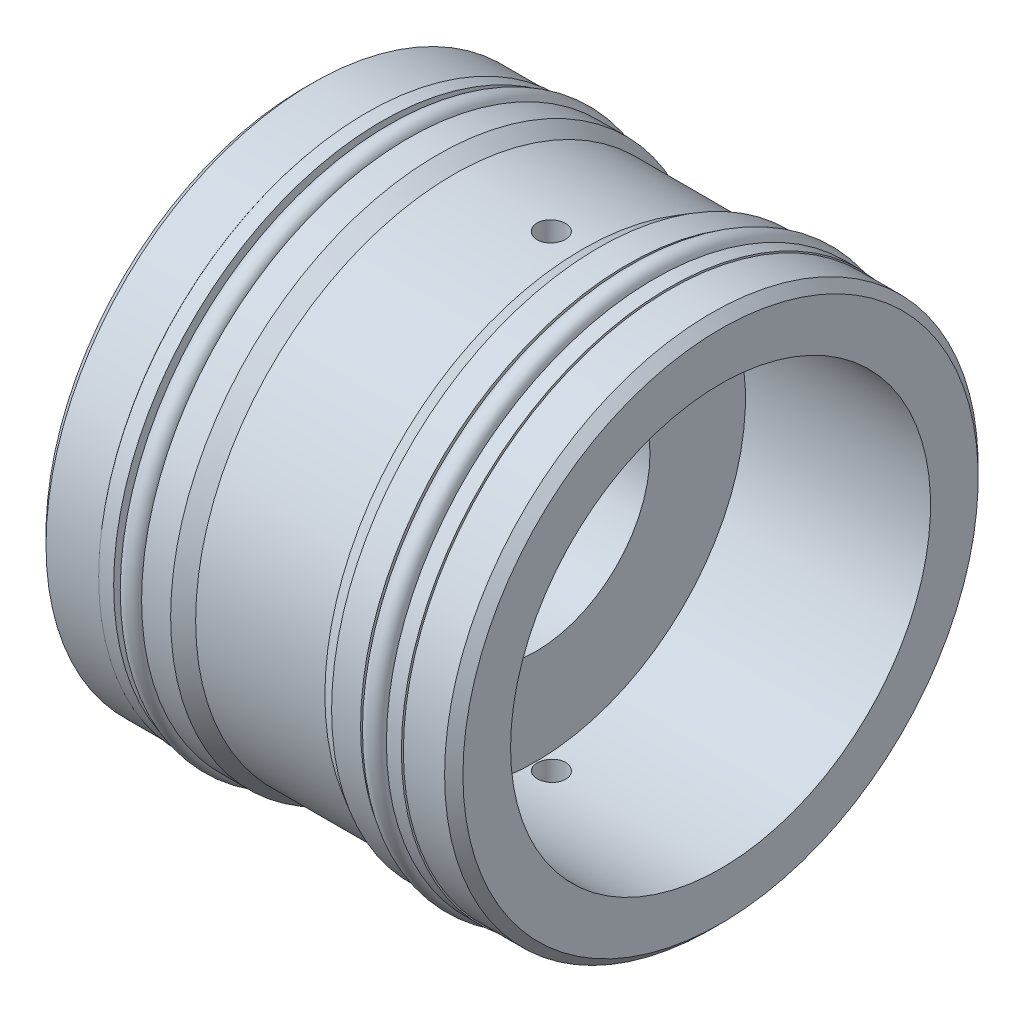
ISO-10303-21;
HEADER;
FILE_DESCRIPTION(('STEP AP214'),'2;1');
FILE_NAME('part.step','',(''),(''),'','','');
FILE_SCHEMA(('AUTOMOTIVE_DESIGN { 1 0 10303 214 1 1 1 1 }'));
ENDSEC;
DATA;
#1=APPLICATION_CONTEXT('core data for automotive mechanical design processes');
#2=APPLICATION_PROTOCOL_DEFINITION('international standard','automotive_design',2000,#1);
#3=PRODUCT_CONTEXT('',#1,'mechanical');
#4=PRODUCT('Part','Part','',(#3));
#5=PRODUCT_RELATED_PRODUCT_CATEGORY('part','',(#4));
#6=PRODUCT_DEFINITION_FORMATION('','',#4);
#7=PRODUCT_DEFINITION_CONTEXT('part definition',#1,'design');
#8=PRODUCT_DEFINITION('design','',#6,#7);
#9=PRODUCT_DEFINITION_SHAPE('','',#8);
#10=(LENGTH_UNIT() NAMED_UNIT(*) SI_UNIT(.MILLI.,.METRE.));
#11=(NAMED_UNIT(*) PLANE_ANGLE_UNIT() SI_UNIT($,.RADIAN.));
#12=(NAMED_UNIT(*) SI_UNIT($,.STERADIAN.) SOLID_ANGLE_UNIT());
#13=UNCERTAINTY_MEASURE_WITH_UNIT(LENGTH_MEASURE(1.E-05),#10,'distance_accuracy_value','');
#14=(GEOMETRIC_REPRESENTATION_CONTEXT(3) GLOBAL_UNCERTAINTY_ASSIGNED_CONTEXT((#13)) GLOBAL_UNIT_ASSIGNED_CONTEXT((#10,
#11,#12)) REPRESENTATION_CONTEXT('',''));
#15=CARTESIAN_POINT('',(0.,0.,0.));
#16=DIRECTION('',(0.,0.,1.));
#17=DIRECTION('',(1.,0.,0.));
#18=AXIS2_PLACEMENT_3D('',#15,#16,#17);
#19=CARTESIAN_POINT('',(0.,0.,0.));
#20=DIRECTION('',(-1.,0.,0.));
#21=DIRECTION('',(0.,0.,1.));
#22=AXIS2_PLACEMENT_3D('',#19,#20,#21);
#23=CYLINDRICAL_SURFACE('',#22,21.4249);
#24=CARTESIAN_POINT('',(5.8556772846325,0.,0.));
#25=DIRECTION('',(1.,0.,0.));
#26=DIRECTION('',(0.,0.,-1.));
#27=AXIS2_PLACEMENT_3D('',#24,#25,#26);
#28=CIRCLE('',#27,21.4249);
#29=CARTESIAN_POINT('',(5.8556772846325,0.,-21.4249));
#30=VERTEX_POINT('',#29);
#31=EDGE_CURVE('E38',#30,#30,#28,.T.);
#32=ORIENTED_EDGE('',*,*,#31,.F.);
#33=EDGE_LOOP('',(#32));
#34=FACE_BOUND('',#33,.T.);
#35=CARTESIAN_POINT('',(3.2639,-21.3923197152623,1.1811));
#36=CARTESIAN_POINT('',(3.3301888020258,-21.3923201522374,1.18109707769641));
#37=CARTESIAN_POINT('',(3.39652438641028,-21.3926311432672,1.17550060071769));
#38=CARTESIAN_POINT('',(3.5273649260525,-21.393841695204,1.15325488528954));
#39=CARTESIAN_POINT('',(3.59186764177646,-21.3947419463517,1.13659268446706));
#40=CARTESIAN_POINT('',(3.71712819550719,-21.3970287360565,1.09269462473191));
#41=CARTESIAN_POINT('',(3.77788794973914,-21.3984150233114,1.06546422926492));
#42=CARTESIAN_POINT('',(3.89395795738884,-21.4015173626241,1.0012113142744));
#43=CARTESIAN_POINT('',(3.94926947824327,-21.4032333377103,0.964191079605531));
#44=CARTESIAN_POINT('',(4.05295557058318,-21.4068040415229,0.881360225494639));
#45=CARTESIAN_POINT('',(4.10132276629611,-21.4086589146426,0.835540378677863));
#46=CARTESIAN_POINT('',(4.18968425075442,-21.4122970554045,0.736429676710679));
#47=CARTESIAN_POINT('',(4.2296781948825,-21.4140803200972,0.683138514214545));
#48=CARTESIAN_POINT('',(4.30017919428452,-21.4173754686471,0.570558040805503));
#49=CARTESIAN_POINT('',(4.33068035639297,-21.4188871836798,0.511265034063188));
#50=CARTESIAN_POINT('',(4.38129219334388,-21.4214674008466,0.38838996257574));
#51=CARTESIAN_POINT('',(4.4014029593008,-21.4225359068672,0.324807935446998));
#52=CARTESIAN_POINT('',(4.43064324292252,-21.4241083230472,0.195228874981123));
#53=CARTESIAN_POINT('',(4.43978401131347,-21.4246128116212,0.129234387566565));
#54=CARTESIAN_POINT('',(4.44685955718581,-21.4250022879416,-0.00335405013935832));
#55=CARTESIAN_POINT('',(4.44479443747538,-21.4248872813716,-0.0699479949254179));
#56=CARTESIAN_POINT('',(4.42952614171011,-21.4240512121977,-0.201768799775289));
#57=CARTESIAN_POINT('',(4.41633507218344,-21.4233308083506,-0.266997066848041));
#58=CARTESIAN_POINT('',(4.37920809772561,-21.4213658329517,-0.394312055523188));
#59=CARTESIAN_POINT('',(4.35527214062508,-21.4201212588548,-0.456398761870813));
#60=CARTESIAN_POINT('',(4.29732107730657,-21.4172469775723,-0.575707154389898));
#61=CARTESIAN_POINT('',(4.26330046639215,-21.4156170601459,-0.632926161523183));
#62=CARTESIAN_POINT('',(4.18614982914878,-21.4121556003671,-0.740845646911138));
#63=CARTESIAN_POINT('',(4.1430197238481,-21.4103240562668,-0.791546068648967));
#64=CARTESIAN_POINT('',(4.04880598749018,-21.4066626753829,-0.885059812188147));
#65=CARTESIAN_POINT('',(3.99771185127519,-21.4048328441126,-0.927862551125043));
#66=CARTESIAN_POINT('',(3.88905729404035,-21.4013836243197,-1.00428436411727));
#67=CARTESIAN_POINT('',(3.83149687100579,-21.3997642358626,-1.03790343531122));
#68=CARTESIAN_POINT('',(3.71153715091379,-21.3969187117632,-1.09500273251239));
#69=CARTESIAN_POINT('',(3.64913765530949,-21.3956925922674,-1.11848254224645));
#70=CARTESIAN_POINT('',(3.52127404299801,-21.3937724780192,-1.15462965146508));
#71=CARTESIAN_POINT('',(3.45580995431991,-21.393078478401,-1.16729704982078));
#72=CARTESIAN_POINT('',(3.32376767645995,-21.3923017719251,-1.18144662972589));
#73=CARTESIAN_POINT('',(3.25719106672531,-21.3922182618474,-1.18294350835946));
#74=CARTESIAN_POINT('',(3.12473253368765,-21.3926698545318,-1.17474792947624));
#75=CARTESIAN_POINT('',(3.05885060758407,-21.3932049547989,-1.16505551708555));
#76=CARTESIAN_POINT('',(2.92969297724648,-21.394832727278,-1.13476868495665));
#77=CARTESIAN_POINT('',(2.86641568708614,-21.3959250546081,-1.11418100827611));
#78=CARTESIAN_POINT('',(2.74421464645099,-21.3985438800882,-1.06269488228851));
#79=CARTESIAN_POINT('',(2.68529092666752,-21.4000703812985,-1.0317963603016));
#80=CARTESIAN_POINT('',(2.57340207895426,-21.4033874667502,-0.960527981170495));
#81=CARTESIAN_POINT('',(2.52044324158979,-21.4051783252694,-0.920148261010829));
#82=CARTESIAN_POINT('',(2.42205077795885,-21.4088213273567,-0.831078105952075));
#83=CARTESIAN_POINT('',(2.37661720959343,-21.4106734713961,-0.78238760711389));
#84=CARTESIAN_POINT('',(2.29451548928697,-21.4142326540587,-0.678014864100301));
#85=CARTESIAN_POINT('',(2.25785683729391,-21.415939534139,-0.622325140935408));
#86=CARTESIAN_POINT('',(2.19441052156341,-21.4190135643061,-0.50557250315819));
#87=CARTESIAN_POINT('',(2.16762280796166,-21.4203807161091,-0.444509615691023));
#88=CARTESIAN_POINT('',(2.12469535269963,-21.422620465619,-0.318779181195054));
#89=CARTESIAN_POINT('',(2.10854955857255,-21.423493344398,-0.254113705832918));
#90=CARTESIAN_POINT('',(2.08734444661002,-21.4246473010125,-0.122984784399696));
#91=CARTESIAN_POINT('',(2.08228504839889,-21.4249283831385,-0.0565213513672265));
#92=CARTESIAN_POINT('',(2.08339710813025,-21.4248670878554,0.0762226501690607));
#93=CARTESIAN_POINT('',(2.08955367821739,-21.4245255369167,0.142503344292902));
#94=CARTESIAN_POINT('',(2.11289209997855,-21.4232590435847,0.273088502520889));
#95=CARTESIAN_POINT('',(2.13007397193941,-21.4223341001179,0.337392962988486));
#96=CARTESIAN_POINT('',(2.17497208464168,-21.4200048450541,0.462203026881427));
#97=CARTESIAN_POINT('',(2.20268835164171,-21.418600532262,0.522708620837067));
#98=CARTESIAN_POINT('',(2.26786615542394,-21.4154703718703,0.638209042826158));
#99=CARTESIAN_POINT('',(2.30532741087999,-21.413744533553,0.69320402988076));
#100=CARTESIAN_POINT('',(2.38898595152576,-21.410162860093,0.796197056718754));
#101=CARTESIAN_POINT('',(2.43519380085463,-21.4083068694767,0.844186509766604));
#102=CARTESIAN_POINT('',(2.53502338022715,-21.4046752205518,0.931742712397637));
#103=CARTESIAN_POINT('',(2.58864692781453,-21.4028995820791,0.97130739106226));
#104=CARTESIAN_POINT('',(2.70183519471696,-21.399627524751,1.04091360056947));
#105=CARTESIAN_POINT('',(2.76140619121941,-21.3981314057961,1.07094492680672));
#106=CARTESIAN_POINT('',(2.88470895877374,-21.395591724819,1.12054330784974));
#107=CARTESIAN_POINT('',(2.94843573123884,-21.3945476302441,1.1401226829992));
#108=CARTESIAN_POINT('',(3.0544467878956,-21.3933052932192,1.16314357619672));
#109=CARTESIAN_POINT('',(3.09604493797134,-21.3929373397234,1.16986859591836));
#110=CARTESIAN_POINT('',(3.17972243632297,-21.3924444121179,1.1788477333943));
#111=CARTESIAN_POINT('',(3.22180178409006,-21.3923194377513,1.18110185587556));
#112=CARTESIAN_POINT('',(3.2639,-21.3923197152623,1.1811));
#113=B_SPLINE_CURVE_WITH_KNOTS('',3,(#35,#36,#37,#38,#39,#40,#41,#42,#43,#44,#45,#46,#47,#48,
#49,#50,#51,#52,#53,#54,#55,#56,#57,#58,#59,#60,#61,#62,#63,#64,#65,#66,#67,#68,#69,#70,#71,#72,
#73,#74,#75,#76,#77,#78,#79,#80,#81,#82,#83,#84,#85,#86,#87,#88,#89,#90,#91,#92,#93,#94,#95,#96,
#97,#98,#99,#100,#101,#102,#103,#104,#105,#106,#107,#108,#109,#110,#111,#112),.UNSPECIFIED.,.T.,
.F.,(4,2,2,2,2,2,2,2,2,2,2,2,2,2,2,2,2,2,2,2,2,2,2,2,2,2,2,2,2,2,2,2,2,2,2,2,2,2,4),(0.,
0.198712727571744,0.397658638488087,0.596501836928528,0.795298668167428,0.994305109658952,
1.19331974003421,1.39245767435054,1.59159386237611,1.7905256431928,1.98945559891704,
2.18816937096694,2.38688410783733,2.58570751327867,2.78453264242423,2.98362229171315,
3.182712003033,3.38180988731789,3.5809059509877,3.77974001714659,3.97857328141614,
4.17728363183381,4.37599538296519,4.57491477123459,4.77383568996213,4.97297100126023,
5.172105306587,5.37112625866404,5.57014576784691,5.76890129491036,5.96765718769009,
6.16641357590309,6.36516422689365,6.56415647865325,6.76319758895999,6.96245104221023,
7.16146910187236,7.28766628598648,7.41386333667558),.UNSPECIFIED.);
#114=CARTESIAN_POINT('',(3.2639,-21.3923197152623,1.1811));
#115=VERTEX_POINT('',#114);
#116=EDGE_CURVE('E49',#115,#115,#113,.T.);
#117=ORIENTED_EDGE('',*,*,#116,.T.);
#118=EDGE_LOOP('',(#117));
#119=FACE_BOUND('',#118,.T.);
#120=CARTESIAN_POINT('',(3.2639,21.3923197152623,1.1811));
#121=CARTESIAN_POINT('',(3.1976111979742,21.3923201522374,1.18109707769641));
#122=CARTESIAN_POINT('',(3.13127561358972,21.3926311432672,1.17550060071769));
#123=CARTESIAN_POINT('',(3.0004350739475,21.393841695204,1.15325488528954));
#124=CARTESIAN_POINT('',(2.93593235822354,21.3947419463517,1.13659268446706));
#125=CARTESIAN_POINT('',(2.81067180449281,21.3970287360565,1.09269462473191));
#126=CARTESIAN_POINT('',(2.74991205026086,21.3984150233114,1.06546422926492));
#127=CARTESIAN_POINT('',(2.63384204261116,21.4015173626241,1.0012113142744));
#128=CARTESIAN_POINT('',(2.57853052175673,21.4032333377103,0.964191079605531));
#129=CARTESIAN_POINT('',(2.47484442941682,21.4068040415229,0.881360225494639));
#130=CARTESIAN_POINT('',(2.42647723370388,21.4086589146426,0.835540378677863));
#131=CARTESIAN_POINT('',(2.33811574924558,21.4122970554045,0.736429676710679));
#132=CARTESIAN_POINT('',(2.2981218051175,21.4140803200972,0.683138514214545));
#133=CARTESIAN_POINT('',(2.22762080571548,21.4173754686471,0.570558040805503));
#134=CARTESIAN_POINT('',(2.19711964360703,21.4188871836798,0.511265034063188));
#135=CARTESIAN_POINT('',(2.14650780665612,21.4214674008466,0.38838996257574));
#136=CARTESIAN_POINT('',(2.1263970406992,21.4225359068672,0.324807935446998));
#137=CARTESIAN_POINT('',(2.09715675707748,21.4241083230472,0.195228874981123));
#138=CARTESIAN_POINT('',(2.08801598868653,21.4246128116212,0.129234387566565));
#139=CARTESIAN_POINT('',(2.08094044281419,21.4250022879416,-0.00335405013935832));
#140=CARTESIAN_POINT('',(2.08300556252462,21.4248872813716,-0.0699479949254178));
#141=CARTESIAN_POINT('',(2.09827385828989,21.4240512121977,-0.201768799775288));
#142=CARTESIAN_POINT('',(2.11146492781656,21.4233308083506,-0.26699706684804));
#143=CARTESIAN_POINT('',(2.14859190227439,21.4213658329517,-0.394312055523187));
#144=CARTESIAN_POINT('',(2.17252785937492,21.4201212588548,-0.456398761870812));
#145=CARTESIAN_POINT('',(2.23047892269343,21.4172469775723,-0.575707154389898));
#146=CARTESIAN_POINT('',(2.26449953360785,21.4156170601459,-0.632926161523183));
#147=CARTESIAN_POINT('',(2.34165017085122,21.4121556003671,-0.740845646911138));
#148=CARTESIAN_POINT('',(2.3847802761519,21.4103240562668,-0.791546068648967));
#149=CARTESIAN_POINT('',(2.47899401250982,21.4066626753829,-0.885059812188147));
#150=CARTESIAN_POINT('',(2.53008814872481,21.4048328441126,-0.927862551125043));
#151=CARTESIAN_POINT('',(2.63874270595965,21.4013836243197,-1.00428436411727));
#152=CARTESIAN_POINT('',(2.69630312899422,21.3997642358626,-1.03790343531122));
#153=CARTESIAN_POINT('',(2.81626284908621,21.3969187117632,-1.09500273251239));
#154=CARTESIAN_POINT('',(2.87866234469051,21.3956925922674,-1.11848254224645));
#155=CARTESIAN_POINT('',(3.00652595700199,21.3937724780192,-1.15462965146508));
#156=CARTESIAN_POINT('',(3.07199004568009,21.393078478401,-1.16729704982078));
#157=CARTESIAN_POINT('',(3.20403232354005,21.3923017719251,-1.18144662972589));
#158=CARTESIAN_POINT('',(3.27060893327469,21.3922182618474,-1.18294350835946));
#159=CARTESIAN_POINT('',(3.40306746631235,21.3926698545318,-1.17474792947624));
#160=CARTESIAN_POINT('',(3.46894939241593,21.3932049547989,-1.16505551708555));
#161=CARTESIAN_POINT('',(3.59810702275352,21.394832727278,-1.13476868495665));
#162=CARTESIAN_POINT('',(3.66138431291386,21.3959250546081,-1.11418100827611));
#163=CARTESIAN_POINT('',(3.78358535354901,21.3985438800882,-1.06269488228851));
#164=CARTESIAN_POINT('',(3.84250907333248,21.4000703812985,-1.0317963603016));
#165=CARTESIAN_POINT('',(3.95439792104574,21.4033874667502,-0.960527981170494));
#166=CARTESIAN_POINT('',(4.00735675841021,21.4051783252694,-0.920148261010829));
#167=CARTESIAN_POINT('',(4.10574922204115,21.4088213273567,-0.831078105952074));
#168=CARTESIAN_POINT('',(4.15118279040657,21.4106734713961,-0.782387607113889));
#169=CARTESIAN_POINT('',(4.23328451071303,21.4142326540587,-0.6780148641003));
#170=CARTESIAN_POINT('',(4.26994316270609,21.415939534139,-0.622325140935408));
#171=CARTESIAN_POINT('',(4.33338947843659,21.4190135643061,-0.50557250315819));
#172=CARTESIAN_POINT('',(4.36017719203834,21.4203807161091,-0.444509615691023));
#173=CARTESIAN_POINT('',(4.40310464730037,21.422620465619,-0.318779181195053));
#174=CARTESIAN_POINT('',(4.41925044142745,21.423493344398,-0.254113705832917));
#175=CARTESIAN_POINT('',(4.44045555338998,21.4246473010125,-0.122984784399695));
#176=CARTESIAN_POINT('',(4.44551495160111,21.4249283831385,-0.0565213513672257));
#177=CARTESIAN_POINT('',(4.44440289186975,21.4248670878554,0.0762226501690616));
#178=CARTESIAN_POINT('',(4.43824632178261,21.4245255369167,0.142503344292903));
#179=CARTESIAN_POINT('',(4.41490790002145,21.4232590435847,0.27308850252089));
#180=CARTESIAN_POINT('',(4.39772602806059,21.4223341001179,0.337392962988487));
#181=CARTESIAN_POINT('',(4.35282791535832,21.4200048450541,0.462203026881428));
#182=CARTESIAN_POINT('',(4.32511164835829,21.418600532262,0.522708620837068));
#183=CARTESIAN_POINT('',(4.25993384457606,21.4154703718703,0.638209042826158));
#184=CARTESIAN_POINT('',(4.22247258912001,21.413744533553,0.69320402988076));
#185=CARTESIAN_POINT('',(4.13881404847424,21.410162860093,0.796197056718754));
#186=CARTESIAN_POINT('',(4.09260619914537,21.4083068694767,0.844186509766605));
#187=CARTESIAN_POINT('',(3.99277661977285,21.4046752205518,0.931742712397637));
#188=CARTESIAN_POINT('',(3.93915307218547,21.4028995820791,0.97130739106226));
#189=CARTESIAN_POINT('',(3.82596480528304,21.399627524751,1.04091360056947));
#190=CARTESIAN_POINT('',(3.76639380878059,21.3981314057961,1.07094492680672));
#191=CARTESIAN_POINT('',(3.64309104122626,21.395591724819,1.12054330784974));
#192=CARTESIAN_POINT('',(3.57936426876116,21.3945476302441,1.1401226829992));
#193=CARTESIAN_POINT('',(3.4733532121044,21.3933052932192,1.16314357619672));
#194=CARTESIAN_POINT('',(3.43175506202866,21.3929373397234,1.16986859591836));
#195=CARTESIAN_POINT('',(3.34807756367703,21.3924444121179,1.1788477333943));
#196=CARTESIAN_POINT('',(3.30599821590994,21.3923194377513,1.18110185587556));
#197=CARTESIAN_POINT('',(3.2639,21.3923197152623,1.1811));
#198=B_SPLINE_CURVE_WITH_KNOTS('',3,(#120,#121,#122,#123,#124,#125,#126,#127,#128,#129,#130,
#131,#132,#133,#134,#135,#136,#137,#138,#139,#140,#141,#142,#143,#144,#145,#146,#147,#148,#149,
#150,#151,#152,#153,#154,#155,#156,#157,#158,#159,#160,#161,#162,#163,#164,#165,#166,#167,#168,
#169,#170,#171,#172,#173,#174,#175,#176,#177,#178,#179,#180,#181,#182,#183,#184,#185,#186,#187,
#188,#189,#190,#191,#192,#193,#194,#195,#196,#197),.UNSPECIFIED.,.T.,.F.,(4,2,2,2,2,2,2,2,2,2,2,
2,2,2,2,2,2,2,2,2,2,2,2,2,2,2,2,2,2,2,2,2,2,2,2,2,2,2,4),(0.,0.198712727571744,
0.397658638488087,0.596501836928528,0.795298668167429,0.994305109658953,1.19331974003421,
1.39245767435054,1.59159386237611,1.7905256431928,1.98945559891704,2.18816937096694,
2.38688410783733,2.58570751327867,2.78453264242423,2.98362229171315,3.18271200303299,
3.38180988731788,3.5809059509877,3.77974001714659,3.97857328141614,4.17728363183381,
4.37599538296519,4.57491477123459,4.77383568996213,4.97297100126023,5.172105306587,
5.37112625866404,5.57014576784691,5.76890129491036,5.96765718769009,6.16641357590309,
6.36516422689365,6.56415647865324,6.76319758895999,6.96245104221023,7.16146910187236,
7.28766628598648,7.41386333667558),.UNSPECIFIED.);
#199=CARTESIAN_POINT('',(3.2639,21.3923197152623,1.1811));
#200=VERTEX_POINT('',#199);
#201=EDGE_CURVE('E57',#200,#200,#198,.T.);
#202=ORIENTED_EDGE('',*,*,#201,.T.);
#203=EDGE_LOOP('',(#202));
#204=FACE_BOUND('',#203,.T.);
#205=CARTESIAN_POINT('',(-4.8904772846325,0.,0.));
#206=DIRECTION('',(-1.,0.,0.));
#207=DIRECTION('',(0.,0.,1.));
#208=AXIS2_PLACEMENT_3D('',#205,#206,#207);
#209=CIRCLE('',#208,21.4249);
#210=CARTESIAN_POINT('',(-4.8904772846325,0.,21.4249));
#211=VERTEX_POINT('',#210);
#212=EDGE_CURVE('E10',#211,#211,#209,.T.);
#213=ORIENTED_EDGE('',*,*,#212,.F.);
#214=EDGE_LOOP('',(#213));
#215=FACE_BOUND('',#214,.T.);
#216=ADVANCED_FACE('F31',(#34,#119,#204,#215),#23,.T.);
#217=CARTESIAN_POINT('',(0.,0.,0.));
#218=DIRECTION('',(-1.,0.,0.));
#219=DIRECTION('',(0.,0.,1.));
#220=AXIS2_PLACEMENT_3D('',#217,#218,#219);
#221=CYLINDRICAL_SURFACE('',#220,20.9296);
#222=CARTESIAN_POINT('',(10.9138071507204,0.,0.));
#223=DIRECTION('',(-1.,0.,0.));
#224=DIRECTION('',(0.,0.,1.));
#225=AXIS2_PLACEMENT_3D('',#222,#223,#224);
#226=CIRCLE('',#225,20.9296);
#227=CARTESIAN_POINT('',(10.9138071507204,0.,20.9296));
#228=VERTEX_POINT('',#227);
#229=EDGE_CURVE('E207',#228,#228,#226,.T.);
#230=ORIENTED_EDGE('',*,*,#229,.F.);
#231=EDGE_LOOP('',(#230));
#232=FACE_BOUND('',#231,.T.);
#233=CARTESIAN_POINT('',(11.8237,0.,0.));
#234=DIRECTION('',(1.,0.,0.));
#235=DIRECTION('',(0.,0.,-1.));
#236=AXIS2_PLACEMENT_3D('',#233,#234,#235);
#237=CIRCLE('',#236,20.9296);
#238=CARTESIAN_POINT('',(11.8237,0.,-20.9296));
#239=VERTEX_POINT('',#238);
#240=EDGE_CURVE('E42',#239,#239,#237,.T.);
#241=ORIENTED_EDGE('',*,*,#240,.F.);
#242=EDGE_LOOP('',(#241));
#243=FACE_BOUND('',#242,.T.);
#244=ADVANCED_FACE('F122',(#232,#243),#221,.T.);
#245=CARTESIAN_POINT('',(13.1445,0.,0.));
#246=DIRECTION('',(-1.,0.,0.));
#247=DIRECTION('',(0.,0.,1.));
#248=AXIS2_PLACEMENT_3D('',#245,#246,#247);
#249=CIRCLE('',#248,20.9296);
#250=CARTESIAN_POINT('',(13.1445,0.,20.9296));
#251=VERTEX_POINT('',#250);
#252=EDGE_CURVE('E168',#251,#251,#249,.T.);
#253=ORIENTED_EDGE('',*,*,#252,.T.);
#254=EDGE_LOOP('',(#253));
#255=FACE_BOUND('',#254,.T.);
#256=CARTESIAN_POINT('',(13.0683,0.,0.));
#257=DIRECTION('',(-1.,0.,0.));
#258=DIRECTION('',(0.,0.,1.));
#259=AXIS2_PLACEMENT_3D('',#256,#257,#258);
#260=CIRCLE('',#259,20.9296);
#261=CARTESIAN_POINT('',(13.0683,0.,20.9296));
#262=VERTEX_POINT('',#261);
#263=EDGE_CURVE('E46',#262,#262,#260,.T.);
#264=ORIENTED_EDGE('',*,*,#263,.F.);
#265=EDGE_LOOP('',(#264));
#266=FACE_BOUND('',#265,.T.);
#267=ADVANCED_FACE('F127',(#255,#266),#221,.T.);
#268=CARTESIAN_POINT('',(9.5885,0.,0.));
#269=DIRECTION('',(-1.,0.,0.));
#270=DIRECTION('',(0.,0.,1.));
#271=AXIS2_PLACEMENT_3D('',#268,#269,#270);
#272=CIRCLE('',#271,20.9296);
#273=CARTESIAN_POINT('',(9.5885,0.,20.9296));
#274=VERTEX_POINT('',#273);
#275=EDGE_CURVE('E159',#274,#274,#272,.T.);
#276=ORIENTED_EDGE('',*,*,#275,.F.);
#277=EDGE_LOOP('',(#276));
#278=FACE_BOUND('',#277,.T.);
#279=CARTESIAN_POINT('',(10.1935928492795,0.,0.));
#280=DIRECTION('',(1.,0.,0.));
#281=DIRECTION('',(0.,0.,-1.));
#282=AXIS2_PLACEMENT_3D('',#279,#280,#281);
#283=CIRCLE('',#282,20.9296);
#284=CARTESIAN_POINT('',(10.1935928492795,0.,-20.9296));
#285=VERTEX_POINT('',#284);
#286=EDGE_CURVE('E210',#285,#285,#283,.T.);
#287=ORIENTED_EDGE('',*,*,#286,.F.);
#288=EDGE_LOOP('',(#287));
#289=FACE_BOUND('',#288,.T.);
#290=ADVANCED_FACE('F130',(#278,#289),#221,.T.);
#291=CARTESIAN_POINT('',(0.,0.,0.));
#292=DIRECTION('',(-1.,0.,0.));
#293=DIRECTION('',(0.,0.,1.));
#294=AXIS2_PLACEMENT_3D('',#291,#292,#293);
#295=CYLINDRICAL_SURFACE('',#294,20.9296);
#296=CARTESIAN_POINT('',(-10.8585,0.,0.));
#297=DIRECTION('',(-1.,0.,0.));
#298=DIRECTION('',(0.,0.,1.));
#299=AXIS2_PLACEMENT_3D('',#296,#297,#298);
#300=CIRCLE('',#299,20.9296);
#301=CARTESIAN_POINT('',(-10.8585,0.,20.9296));
#302=VERTEX_POINT('',#301);
#303=EDGE_CURVE('E195',#302,#302,#300,.T.);
#304=ORIENTED_EDGE('',*,*,#303,.F.);
#305=EDGE_LOOP('',(#304));
#306=FACE_BOUND('',#305,.T.);
#307=CARTESIAN_POINT('',(-9.94860715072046,0.,0.));
#308=DIRECTION('',(1.,0.,0.));
#309=DIRECTION('',(0.,0.,-1.));
#310=AXIS2_PLACEMENT_3D('',#307,#308,#309);
#311=CIRCLE('',#310,20.9296);
#312=CARTESIAN_POINT('',(-9.94860715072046,0.,-20.9296));
#313=VERTEX_POINT('',#312);
#314=EDGE_CURVE('E204',#313,#313,#311,.T.);
#315=ORIENTED_EDGE('',*,*,#314,.F.);
#316=EDGE_LOOP('',(#315));
#317=FACE_BOUND('',#316,.T.);
#318=ADVANCED_FACE('F222',(#306,#317),#295,.T.);
#319=CARTESIAN_POINT('',(-8.6233,0.,0.));
#320=DIRECTION('',(-1.,0.,0.));
#321=DIRECTION('',(0.,0.,1.));
#322=AXIS2_PLACEMENT_3D('',#319,#320,#321);
#323=CIRCLE('',#322,20.9296);
#324=CARTESIAN_POINT('',(-8.6233,0.,20.9296));
#325=VERTEX_POINT('',#324);
#326=EDGE_CURVE('E162',#325,#325,#323,.T.);
#327=ORIENTED_EDGE('',*,*,#326,.T.);
#328=EDGE_LOOP('',(#327));
#329=FACE_BOUND('',#328,.T.);
#330=CARTESIAN_POINT('',(-9.22839284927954,0.,0.));
#331=DIRECTION('',(-1.,0.,0.));
#332=DIRECTION('',(0.,0.,1.));
#333=AXIS2_PLACEMENT_3D('',#330,#331,#332);
#334=CIRCLE('',#333,20.9296);
#335=CARTESIAN_POINT('',(-9.22839284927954,0.,20.9296));
#336=VERTEX_POINT('',#335);
#337=EDGE_CURVE('E201',#336,#336,#334,.T.);
#338=ORIENTED_EDGE('',*,*,#337,.F.);
#339=EDGE_LOOP('',(#338));
#340=FACE_BOUND('',#339,.T.);
#341=ADVANCED_FACE('F270',(#329,#340),#295,.T.);
#342=CARTESIAN_POINT('',(-12.1793,0.,0.));
#343=DIRECTION('',(-1.,0.,0.));
#344=DIRECTION('',(0.,0.,1.));
#345=AXIS2_PLACEMENT_3D('',#342,#343,#344);
#346=CIRCLE('',#345,20.9296);
#347=CARTESIAN_POINT('',(-12.1793,0.,20.9296));
#348=VERTEX_POINT('',#347);
#349=EDGE_CURVE('E259',#348,#348,#346,.T.);
#350=ORIENTED_EDGE('',*,*,#349,.F.);
#351=EDGE_LOOP('',(#350));
#352=FACE_BOUND('',#351,.T.);
#353=CARTESIAN_POINT('',(-12.1031,0.,0.));
#354=DIRECTION('',(1.,0.,0.));
#355=DIRECTION('',(0.,0.,-1.));
#356=AXIS2_PLACEMENT_3D('',#353,#354,#355);
#357=CIRCLE('',#356,20.9296);
#358=CARTESIAN_POINT('',(-12.1031,0.,-20.9296));
#359=VERTEX_POINT('',#358);
#360=EDGE_CURVE('E198',#359,#359,#357,.T.);
#361=ORIENTED_EDGE('',*,*,#360,.F.);
#362=EDGE_LOOP('',(#361));
#363=FACE_BOUND('',#362,.T.);
#364=ADVANCED_FACE('F104',(#352,#363),#295,.T.);
#365=CARTESIAN_POINT('',(0.,0.,0.));
#366=DIRECTION('',(-1.,0.,0.));
#367=DIRECTION('',(0.,0.,1.));
#368=AXIS2_PLACEMENT_3D('',#365,#366,#367);
#369=CYLINDRICAL_SURFACE('',#368,9.525);
#370=CARTESIAN_POINT('',(1.9431,0.,0.));
#371=DIRECTION('',(-1.,0.,0.));
#372=DIRECTION('',(0.,0.,1.));
#373=AXIS2_PLACEMENT_3D('',#370,#371,#372);
#374=CIRCLE('',#373,9.525);
#375=CARTESIAN_POINT('',(1.9431,0.,9.525));
#376=VERTEX_POINT('',#375);
#377=EDGE_CURVE('E180',#376,#376,#374,.T.);
#378=ORIENTED_EDGE('',*,*,#377,.F.);
#379=EDGE_LOOP('',(#378));
#380=FACE_BOUND('',#379,.T.);
#381=CARTESIAN_POINT('',(-17.3355,0.,0.));
#382=DIRECTION('',(-1.,0.,0.));
#383=DIRECTION('',(0.,0.,1.));
#384=AXIS2_PLACEMENT_3D('',#381,#382,#383);
#385=CIRCLE('',#384,9.525);
#386=CARTESIAN_POINT('',(-17.3355,0.,9.525));
#387=VERTEX_POINT('',#386);
#388=EDGE_CURVE('E253',#387,#387,#385,.T.);
#389=ORIENTED_EDGE('',*,*,#388,.T.);
#390=EDGE_LOOP('',(#389));
#391=FACE_BOUND('',#390,.T.);
#392=ADVANCED_FACE('F101',(#380,#391),#369,.F.);
#393=CARTESIAN_POINT('',(1.9431,9.525,0.));
#394=DIRECTION('',(-1.,0.,0.));
#395=DIRECTION('',(0.,0.,1.));
#396=AXIS2_PLACEMENT_3D('',#393,#394,#395);
#397=PLANE('',#396);
#398=CARTESIAN_POINT('',(1.9431,0.,0.));
#399=DIRECTION('',(-1.,0.,0.));
#400=DIRECTION('',(0.,0.,1.));
#401=AXIS2_PLACEMENT_3D('',#398,#399,#400);
#402=CIRCLE('',#401,17.4625);
#403=CARTESIAN_POINT('',(1.9431,0.,17.4625));
#404=VERTEX_POINT('',#403);
#405=EDGE_CURVE('E177',#404,#404,#402,.T.);
#406=ORIENTED_EDGE('',*,*,#405,.F.);
#407=EDGE_LOOP('',(#406));
#408=FACE_BOUND('',#407,.T.);
#409=ORIENTED_EDGE('',*,*,#377,.T.);
#410=EDGE_LOOP('',(#409));
#411=FACE_BOUND('',#410,.T.);
#412=ADVANCED_FACE('F95',(#408,#411),#397,.F.);
#413=CARTESIAN_POINT('',(0.,0.,0.));
#414=DIRECTION('',(-1.,0.,0.));
#415=DIRECTION('',(0.,0.,1.));
#416=AXIS2_PLACEMENT_3D('',#413,#414,#415);
#417=CYLINDRICAL_SURFACE('',#416,17.4625);
#418=CARTESIAN_POINT('',(3.2639,-17.4225115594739,1.1811));
#419=CARTESIAN_POINT('',(3.19763855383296,-17.4225120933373,1.18109708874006));
#420=CARTESIAN_POINT('',(3.13133099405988,-17.4228936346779,1.1755052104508));
#421=CARTESIAN_POINT('',(3.00054761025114,-17.4243787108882,1.15327882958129));
#422=CARTESIAN_POINT('',(2.93607399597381,-17.4254830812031,1.13663154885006));
#423=CARTESIAN_POINT('',(2.81087179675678,-17.4282881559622,1.0927754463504));
#424=CARTESIAN_POINT('',(2.75014122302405,-17.4299885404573,1.06557229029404));
#425=CARTESIAN_POINT('',(2.63412380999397,-17.4337936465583,1.00138601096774));
#426=CARTESIAN_POINT('',(2.57883574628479,-17.4358982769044,0.964405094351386));
#427=CARTESIAN_POINT('',(2.47516116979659,-17.4402788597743,0.881642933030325));
#428=CARTESIAN_POINT('',(2.42678537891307,-17.442555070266,0.835848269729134));
#429=CARTESIAN_POINT('',(2.33840041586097,-17.4470199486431,0.736786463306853));
#430=CARTESIAN_POINT('',(2.29839159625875,-17.4492086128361,0.683519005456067));
#431=CARTESIAN_POINT('',(2.22784263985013,-17.4532540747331,0.570962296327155));
#432=CARTESIAN_POINT('',(2.19731147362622,-17.455110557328,0.511667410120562));
#433=CARTESIAN_POINT('',(2.14664191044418,-17.4582797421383,0.388778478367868));
#434=CARTESIAN_POINT('',(2.12650338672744,-17.4595924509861,0.325184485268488));
#435=CARTESIAN_POINT('',(2.09722078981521,-17.4615243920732,0.195606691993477));
#436=CARTESIAN_POINT('',(2.08805978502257,-17.4621446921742,0.129626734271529));
#437=CARTESIAN_POINT('',(2.08093997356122,-17.4626255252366,-0.00293710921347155));
#438=CARTESIAN_POINT('',(2.0829810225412,-17.4624860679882,-0.0695209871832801));
#439=CARTESIAN_POINT('',(2.09819344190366,-17.4614639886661,-0.201287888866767));
#440=CARTESIAN_POINT('',(2.1113466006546,-17.4605825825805,-0.26647302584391));
#441=CARTESIAN_POINT('',(2.14838159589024,-17.4581772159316,-0.393708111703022));
#442=CARTESIAN_POINT('',(2.17226350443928,-17.4566532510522,-0.455758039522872));
#443=CARTESIAN_POINT('',(2.23009863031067,-17.4531322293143,-0.575019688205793));
#444=CARTESIAN_POINT('',(2.26406007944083,-17.4511347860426,-0.632227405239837));
#445=CARTESIAN_POINT('',(2.34108426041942,-17.4468915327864,-0.740136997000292));
#446=CARTESIAN_POINT('',(2.38414711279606,-17.4446457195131,-0.790838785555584));
#447=CARTESIAN_POINT('',(2.47825451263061,-17.4401530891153,-0.884403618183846));
#448=CARTESIAN_POINT('',(2.52931487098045,-17.4379062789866,-0.927250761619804));
#449=CARTESIAN_POINT('',(2.63791253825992,-17.4336694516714,-1.00376738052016));
#450=CARTESIAN_POINT('',(2.6954498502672,-17.4316794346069,-1.03743685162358));
#451=CARTESIAN_POINT('',(2.81537849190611,-17.4281809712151,-1.09464135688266));
#452=CARTESIAN_POINT('',(2.87777015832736,-17.4266725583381,-1.11817568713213));
#453=CARTESIAN_POINT('',(3.00563165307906,-17.4243085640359,-1.15443070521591));
#454=CARTESIAN_POINT('',(3.07110143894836,-17.4234529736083,-1.1671515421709));
#455=CARTESIAN_POINT('',(3.20312193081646,-17.4224928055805,-1.18139859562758));
#456=CARTESIAN_POINT('',(3.26967023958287,-17.4223867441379,-1.1829469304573));
#457=CARTESIAN_POINT('',(3.40208070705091,-17.422933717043,-1.1748628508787));
#458=CARTESIAN_POINT('',(3.46794286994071,-17.4235867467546,-1.16523050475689));
#459=CARTESIAN_POINT('',(3.59704870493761,-17.4255769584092,-1.13507687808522));
#460=CARTESIAN_POINT('',(3.66029477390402,-17.4269134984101,-1.11456581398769));
#461=CARTESIAN_POINT('',(3.78244713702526,-17.4301195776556,-1.06324734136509));
#462=CARTESIAN_POINT('',(3.84135338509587,-17.431989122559,-1.03243982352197));
#463=CARTESIAN_POINT('',(3.95325548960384,-17.4360541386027,-0.96134655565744));
#464=CARTESIAN_POINT('',(4.00624192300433,-17.4382501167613,-0.921046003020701));
#465=CARTESIAN_POINT('',(4.10470531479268,-17.4427187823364,-0.832132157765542));
#466=CARTESIAN_POINT('',(4.15018218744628,-17.4449914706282,-0.78351877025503));
#467=CARTESIAN_POINT('',(4.23241042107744,-17.449361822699,-0.679263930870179));
#468=CARTESIAN_POINT('',(4.26914745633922,-17.4514591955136,-0.623611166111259));
#469=CARTESIAN_POINT('',(4.33275509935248,-17.4552384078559,-0.50691412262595));
#470=CARTESIAN_POINT('',(4.3596257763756,-17.4569202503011,-0.445869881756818));
#471=CARTESIAN_POINT('',(4.40271309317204,-17.4596775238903,-0.320175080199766));
#472=CARTESIAN_POINT('',(4.41893875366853,-17.4607534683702,-0.255527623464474));
#473=CARTESIAN_POINT('',(4.44030496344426,-17.4621797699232,-0.124418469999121));
#474=CARTESIAN_POINT('',(4.44544564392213,-17.4625301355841,-0.0579567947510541));
#475=CARTESIAN_POINT('',(4.4444946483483,-17.4624658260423,0.0747525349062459));
#476=CARTESIAN_POINT('',(4.43842537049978,-17.4620526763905,0.141000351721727));
#477=CARTESIAN_POINT('',(4.41527324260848,-17.4605108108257,0.27153386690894));
#478=CARTESIAN_POINT('',(4.39819037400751,-17.459382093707,0.335819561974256));
#479=CARTESIAN_POINT('',(4.35350119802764,-17.4565359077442,0.460606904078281));
#480=CARTESIAN_POINT('',(4.3258950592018,-17.4548184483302,0.52110861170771));
#481=CARTESIAN_POINT('',(4.26094591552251,-17.4509874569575,0.636621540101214));
#482=CARTESIAN_POINT('',(4.22360314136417,-17.4488739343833,0.691632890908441));
#483=CARTESIAN_POINT('',(4.14015747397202,-17.4444834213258,0.794717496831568));
#484=CARTESIAN_POINT('',(4.09403826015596,-17.4422061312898,0.842777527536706));
#485=CARTESIAN_POINT('',(3.9943732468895,-17.4377472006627,0.930490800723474));
#486=CARTESIAN_POINT('',(3.94082563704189,-17.4355655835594,0.970141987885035));
#487=CARTESIAN_POINT('',(3.82775340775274,-17.4315416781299,1.03994662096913));
#488=CARTESIAN_POINT('',(3.76822065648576,-17.4296998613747,1.07008690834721));
#489=CARTESIAN_POINT('',(3.6449698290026,-17.4265700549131,1.11990682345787));
#490=CARTESIAN_POINT('',(3.5812567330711,-17.4252814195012,1.13959865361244));
#491=CARTESIAN_POINT('',(3.47494734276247,-17.4237402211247,1.16286709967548));
#492=CARTESIAN_POINT('',(3.43303752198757,-17.4232815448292,1.16969554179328));
#493=CARTESIAN_POINT('',(3.34872476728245,-17.4226670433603,1.17881292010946));
#494=CARTESIAN_POINT('',(3.30632183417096,-17.4225112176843,1.18110186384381));
#495=CARTESIAN_POINT('',(3.2639,-17.4225115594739,1.1811));
#496=B_SPLINE_CURVE_WITH_KNOTS('',3,(#418,#419,#420,#421,#422,#423,#424,#425,#426,#427,#428,
#429,#430,#431,#432,#433,#434,#435,#436,#437,#438,#439,#440,#441,#442,#443,#444,#445,#446,#447,
#448,#449,#450,#451,#452,#453,#454,#455,#456,#457,#458,#459,#460,#461,#462,#463,#464,#465,#466,
#467,#468,#469,#470,#471,#472,#473,#474,#475,#476,#477,#478,#479,#480,#481,#482,#483,#484,#485,
#486,#487,#488,#489,#490,#491,#492,#493,#494,#495),.UNSPECIFIED.,.T.,.F.,(4,2,2,2,2,2,2,2,2,2,2,
2,2,2,2,2,2,2,2,2,2,2,2,2,2,2,2,2,2,2,2,2,2,2,2,2,2,2,4),(0.,0.198629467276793,0.39748891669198,
0.596241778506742,0.794949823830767,0.993962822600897,1.19298420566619,1.39219339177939,
1.59140014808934,1.7902992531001,1.98919579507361,2.18776699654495,2.38633953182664,
2.58507468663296,2.78381247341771,2.98294823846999,3.18208409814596,3.38123378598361,
3.58038072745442,3.7791333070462,3.977884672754,4.17644971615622,4.3750168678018,
4.5738957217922,4.77277684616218,4.97198175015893,5.17118525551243,5.37021973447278,
5.56925185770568,5.76788673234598,5.9665219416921,6.16515396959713,6.36378129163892,
6.56278165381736,6.7618306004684,6.9611537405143,7.16024358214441,7.2874101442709,
7.41457649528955),.UNSPECIFIED.);
#497=CARTESIAN_POINT('',(3.2639,-17.4225115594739,1.1811));
#498=VERTEX_POINT('',#497);
#499=EDGE_CURVE('E84',#498,#498,#496,.T.);
#500=ORIENTED_EDGE('',*,*,#499,.T.);
#501=EDGE_LOOP('',(#500));
#502=FACE_BOUND('',#501,.T.);
#503=CARTESIAN_POINT('',(3.2639,17.4225115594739,1.1811));
#504=CARTESIAN_POINT('',(3.33016144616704,17.4225120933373,1.18109708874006));
#505=CARTESIAN_POINT('',(3.39646900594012,17.4228936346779,1.1755052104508));
#506=CARTESIAN_POINT('',(3.52725238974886,17.4243787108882,1.15327882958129));
#507=CARTESIAN_POINT('',(3.59172600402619,17.4254830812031,1.13663154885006));
#508=CARTESIAN_POINT('',(3.71692820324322,17.4282881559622,1.0927754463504));
#509=CARTESIAN_POINT('',(3.77765877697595,17.4299885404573,1.06557229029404));
#510=CARTESIAN_POINT('',(3.89367619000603,17.4337936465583,1.00138601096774));
#511=CARTESIAN_POINT('',(3.94896425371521,17.4358982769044,0.964405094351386));
#512=CARTESIAN_POINT('',(4.05263883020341,17.4402788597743,0.881642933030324));
#513=CARTESIAN_POINT('',(4.10101462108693,17.442555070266,0.835848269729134));
#514=CARTESIAN_POINT('',(4.18939958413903,17.4470199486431,0.736786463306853));
#515=CARTESIAN_POINT('',(4.22940840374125,17.4492086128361,0.683519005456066));
#516=CARTESIAN_POINT('',(4.29995736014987,17.4532540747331,0.570962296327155));
#517=CARTESIAN_POINT('',(4.33048852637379,17.455110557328,0.511667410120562));
#518=CARTESIAN_POINT('',(4.38115808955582,17.4582797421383,0.388778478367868));
#519=CARTESIAN_POINT('',(4.40129661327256,17.4595924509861,0.325184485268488));
#520=CARTESIAN_POINT('',(4.43057921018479,17.4615243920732,0.195606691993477));
#521=CARTESIAN_POINT('',(4.43974021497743,17.4621446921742,0.129626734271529));
#522=CARTESIAN_POINT('',(4.44686002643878,17.4626255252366,-0.00293710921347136));
#523=CARTESIAN_POINT('',(4.4448189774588,17.4624860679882,-0.0695209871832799));
#524=CARTESIAN_POINT('',(4.42960655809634,17.4614639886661,-0.201287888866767));
#525=CARTESIAN_POINT('',(4.4164533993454,17.4605825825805,-0.266473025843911));
#526=CARTESIAN_POINT('',(4.37941840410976,17.4581772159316,-0.393708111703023));
#527=CARTESIAN_POINT('',(4.35553649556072,17.4566532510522,-0.455758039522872));
#528=CARTESIAN_POINT('',(4.29770136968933,17.4531322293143,-0.575019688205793));
#529=CARTESIAN_POINT('',(4.26373992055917,17.4511347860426,-0.632227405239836));
#530=CARTESIAN_POINT('',(4.18671573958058,17.4468915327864,-0.740136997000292));
#531=CARTESIAN_POINT('',(4.14365288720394,17.4446457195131,-0.790838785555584));
#532=CARTESIAN_POINT('',(4.04954548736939,17.4401530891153,-0.884403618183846));
#533=CARTESIAN_POINT('',(3.99848512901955,17.4379062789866,-0.927250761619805));
#534=CARTESIAN_POINT('',(3.88988746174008,17.4336694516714,-1.00376738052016));
#535=CARTESIAN_POINT('',(3.8323501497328,17.4316794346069,-1.03743685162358));
#536=CARTESIAN_POINT('',(3.71242150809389,17.4281809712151,-1.09464135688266));
#537=CARTESIAN_POINT('',(3.65002984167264,17.4266725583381,-1.11817568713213));
#538=CARTESIAN_POINT('',(3.52216834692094,17.4243085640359,-1.15443070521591));
#539=CARTESIAN_POINT('',(3.45669856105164,17.4234529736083,-1.1671515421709));
#540=CARTESIAN_POINT('',(3.32467806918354,17.4224928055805,-1.18139859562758));
#541=CARTESIAN_POINT('',(3.25812976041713,17.4223867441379,-1.1829469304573));
#542=CARTESIAN_POINT('',(3.12571929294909,17.422933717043,-1.1748628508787));
#543=CARTESIAN_POINT('',(3.05985713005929,17.4235867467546,-1.16523050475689));
#544=CARTESIAN_POINT('',(2.93075129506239,17.4255769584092,-1.13507687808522));
#545=CARTESIAN_POINT('',(2.86750522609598,17.4269134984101,-1.11456581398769));
#546=CARTESIAN_POINT('',(2.74535286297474,17.4301195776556,-1.06324734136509));
#547=CARTESIAN_POINT('',(2.68644661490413,17.431989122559,-1.03243982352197));
#548=CARTESIAN_POINT('',(2.57454451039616,17.4360541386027,-0.96134655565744));
#549=CARTESIAN_POINT('',(2.52155807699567,17.4382501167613,-0.9210460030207));
#550=CARTESIAN_POINT('',(2.42309468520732,17.4427187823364,-0.832132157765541));
#551=CARTESIAN_POINT('',(2.37761781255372,17.4449914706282,-0.78351877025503));
#552=CARTESIAN_POINT('',(2.29538957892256,17.449361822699,-0.679263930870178));
#553=CARTESIAN_POINT('',(2.25865254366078,17.4514591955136,-0.623611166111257));
#554=CARTESIAN_POINT('',(2.19504490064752,17.4552384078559,-0.506914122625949));
#555=CARTESIAN_POINT('',(2.16817422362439,17.4569202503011,-0.445869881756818));
#556=CARTESIAN_POINT('',(2.12508690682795,17.4596775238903,-0.320175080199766));
#557=CARTESIAN_POINT('',(2.10886124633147,17.4607534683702,-0.255527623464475));
#558=CARTESIAN_POINT('',(2.08749503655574,17.4621797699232,-0.124418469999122));
#559=CARTESIAN_POINT('',(2.08235435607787,17.4625301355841,-0.0579567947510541));
#560=CARTESIAN_POINT('',(2.0833053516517,17.4624658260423,0.0747525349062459));
#561=CARTESIAN_POINT('',(2.08937462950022,17.4620526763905,0.141000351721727));
#562=CARTESIAN_POINT('',(2.11252675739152,17.4605108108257,0.27153386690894));
#563=CARTESIAN_POINT('',(2.12960962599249,17.459382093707,0.335819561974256));
#564=CARTESIAN_POINT('',(2.17429880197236,17.4565359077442,0.460606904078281));
#565=CARTESIAN_POINT('',(2.2019049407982,17.4548184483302,0.52110861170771));
#566=CARTESIAN_POINT('',(2.26685408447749,17.4509874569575,0.636621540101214));
#567=CARTESIAN_POINT('',(2.30419685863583,17.4488739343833,0.691632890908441));
#568=CARTESIAN_POINT('',(2.38764252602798,17.4444834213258,0.794717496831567));
#569=CARTESIAN_POINT('',(2.43376173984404,17.4422061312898,0.842777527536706));
#570=CARTESIAN_POINT('',(2.5334267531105,17.4377472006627,0.930490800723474));
#571=CARTESIAN_POINT('',(2.58697436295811,17.4355655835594,0.970141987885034));
#572=CARTESIAN_POINT('',(2.70004659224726,17.4315416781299,1.03994662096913));
#573=CARTESIAN_POINT('',(2.75957934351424,17.4296998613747,1.07008690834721));
#574=CARTESIAN_POINT('',(2.8828301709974,17.4265700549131,1.11990682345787));
#575=CARTESIAN_POINT('',(2.9465432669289,17.4252814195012,1.13959865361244));
#576=CARTESIAN_POINT('',(3.05285265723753,17.4237402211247,1.16286709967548));
#577=CARTESIAN_POINT('',(3.09476247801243,17.4232815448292,1.16969554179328));
#578=CARTESIAN_POINT('',(3.17907523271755,17.4226670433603,1.17881292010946));
#579=CARTESIAN_POINT('',(3.22147816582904,17.4225112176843,1.18110186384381));
#580=CARTESIAN_POINT('',(3.2639,17.4225115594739,1.1811));
#581=B_SPLINE_CURVE_WITH_KNOTS('',3,(#503,#504,#505,#506,#507,#508,#509,#510,#511,#512,#513,
#514,#515,#516,#517,#518,#519,#520,#521,#522,#523,#524,#525,#526,#527,#528,#529,#530,#531,#532,
#533,#534,#535,#536,#537,#538,#539,#540,#541,#542,#543,#544,#545,#546,#547,#548,#549,#550,#551,
#552,#553,#554,#555,#556,#557,#558,#559,#560,#561,#562,#563,#564,#565,#566,#567,#568,#569,#570,
#571,#572,#573,#574,#575,#576,#577,#578,#579,#580),.UNSPECIFIED.,.T.,.F.,(4,2,2,2,2,2,2,2,2,2,2,
2,2,2,2,2,2,2,2,2,2,2,2,2,2,2,2,2,2,2,2,2,2,2,2,2,2,2,4),(0.,0.198629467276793,0.39748891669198,
0.596241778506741,0.794949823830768,0.993962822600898,1.19298420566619,1.39219339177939,
1.59140014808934,1.7902992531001,1.98919579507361,2.18776699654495,2.38633953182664,
2.58507468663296,2.78381247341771,2.98294823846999,3.18208409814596,3.38123378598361,
3.58038072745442,3.7791333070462,3.977884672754,4.17644971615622,4.37501686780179,
4.5738957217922,4.77277684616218,4.97198175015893,5.17118525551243,5.37021973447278,
5.56925185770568,5.76788673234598,5.9665219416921,6.16515396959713,6.36378129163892,
6.56278165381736,6.7618306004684,6.9611537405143,7.1602435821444,7.28741014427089,
7.41457649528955),.UNSPECIFIED.);
#582=CARTESIAN_POINT('',(3.2639,17.4225115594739,1.1811));
#583=VERTEX_POINT('',#582);
#584=EDGE_CURVE('E56',#583,#583,#581,.T.);
#585=ORIENTED_EDGE('',*,*,#584,.T.);
#586=EDGE_LOOP('',(#585));
#587=FACE_BOUND('',#586,.T.);
#588=CARTESIAN_POINT('',(17.3355,0.,0.));
#589=DIRECTION('',(-1.,0.,0.));
#590=DIRECTION('',(0.,0.,1.));
#591=AXIS2_PLACEMENT_3D('',#588,#589,#590);
#592=CIRCLE('',#591,17.4625);
#593=CARTESIAN_POINT('',(17.3355,0.,17.4625));
#594=VERTEX_POINT('',#593);
#595=EDGE_CURVE('E174',#594,#594,#592,.T.);
#596=ORIENTED_EDGE('',*,*,#595,.F.);
#597=EDGE_LOOP('',(#596));
#598=FACE_BOUND('',#597,.T.);
#599=ORIENTED_EDGE('',*,*,#405,.T.);
#600=EDGE_LOOP('',(#599));
#601=FACE_BOUND('',#600,.T.);
#602=ADVANCED_FACE('F89',(#502,#587,#598,#601),#417,.F.);
#603=CARTESIAN_POINT('',(17.3355,22.1869,0.));
#604=DIRECTION('',(-1.,0.,0.));
#605=DIRECTION('',(0.,0.,1.));
#606=AXIS2_PLACEMENT_3D('',#603,#604,#605);
#607=PLANE('',#606);
#608=CARTESIAN_POINT('',(17.3355,0.,0.));
#609=DIRECTION('',(-1.,0.,0.));
#610=DIRECTION('',(0.,0.,1.));
#611=AXIS2_PLACEMENT_3D('',#608,#609,#610);
#612=CIRCLE('',#611,21.4249);
#613=CARTESIAN_POINT('',(17.3355,0.,21.4249));
#614=VERTEX_POINT('',#613);
#615=EDGE_CURVE('E186',#614,#614,#612,.F.);
#616=ORIENTED_EDGE('',*,*,#615,.T.);
#617=EDGE_LOOP('',(#616));
#618=FACE_BOUND('',#617,.T.);
#619=ORIENTED_EDGE('',*,*,#595,.T.);
#620=EDGE_LOOP('',(#619));
#621=FACE_BOUND('',#620,.T.);
#622=ADVANCED_FACE('F94',(#618,#621),#607,.F.);
#623=CARTESIAN_POINT('',(0.,0.,0.));
#624=DIRECTION('',(-1.,0.,0.));
#625=DIRECTION('',(0.,0.,1.));
#626=AXIS2_PLACEMENT_3D('',#623,#624,#625);
#627=CYLINDRICAL_SURFACE('',#626,22.1869);
#628=CARTESIAN_POINT('',(16.5735,0.,0.));
#629=DIRECTION('',(-1.,0.,0.));
#630=DIRECTION('',(0.,0.,1.));
#631=AXIS2_PLACEMENT_3D('',#628,#629,#630);
#632=CIRCLE('',#631,22.1869);
#633=CARTESIAN_POINT('',(16.5735,0.,22.1869));
#634=VERTEX_POINT('',#633);
#635=EDGE_CURVE('E183',#634,#634,#632,.T.);
#636=ORIENTED_EDGE('',*,*,#635,.T.);
#637=EDGE_LOOP('',(#636));
#638=FACE_BOUND('',#637,.T.);
#639=CARTESIAN_POINT('',(13.1445,0.,0.));
#640=DIRECTION('',(-1.,0.,0.));
#641=DIRECTION('',(0.,0.,1.));
#642=AXIS2_PLACEMENT_3D('',#639,#640,#641);
#643=CIRCLE('',#642,22.1869);
#644=CARTESIAN_POINT('',(13.1445,0.,22.1869));
#645=VERTEX_POINT('',#644);
#646=EDGE_CURVE('E171',#645,#645,#643,.T.);
#647=ORIENTED_EDGE('',*,*,#646,.F.);
#648=EDGE_LOOP('',(#647));
#649=FACE_BOUND('',#648,.T.);
#650=ADVANCED_FACE('F229',(#638,#649),#627,.T.);
#651=CARTESIAN_POINT('',(13.1445,22.1869,0.));
#652=DIRECTION('',(1.,0.,0.));
#653=DIRECTION('',(0.,0.,-1.));
#654=AXIS2_PLACEMENT_3D('',#651,#652,#653);
#655=PLANE('',#654);
#656=ORIENTED_EDGE('',*,*,#252,.F.);
#657=EDGE_LOOP('',(#656));
#658=FACE_BOUND('',#657,.T.);
#659=ORIENTED_EDGE('',*,*,#646,.T.);
#660=EDGE_LOOP('',(#659));
#661=FACE_BOUND('',#660,.T.);
#662=ADVANCED_FACE('F227',(#658,#661),#655,.F.);
#663=CARTESIAN_POINT('',(9.5885,20.9296,0.));
#664=DIRECTION('',(-1.,0.,0.));
#665=DIRECTION('',(0.,0.,1.));
#666=AXIS2_PLACEMENT_3D('',#663,#664,#665);
#667=PLANE('',#666);
#668=CARTESIAN_POINT('',(9.5885,0.,0.));
#669=DIRECTION('',(-1.,0.,0.));
#670=DIRECTION('',(0.,0.,1.));
#671=AXIS2_PLACEMENT_3D('',#668,#669,#670);
#672=CIRCLE('',#671,22.1869);
#673=CARTESIAN_POINT('',(9.5885,0.,22.1869));
#674=VERTEX_POINT('',#673);
#675=EDGE_CURVE('E155',#674,#674,#672,.T.);
#676=ORIENTED_EDGE('',*,*,#675,.F.);
#677=EDGE_LOOP('',(#676));
#678=FACE_BOUND('',#677,.T.);
#679=ORIENTED_EDGE('',*,*,#275,.T.);
#680=EDGE_LOOP('',(#679));
#681=FACE_BOUND('',#680,.T.);
#682=ADVANCED_FACE('F226',(#678,#681),#667,.F.);
#683=CARTESIAN_POINT('',(0.,0.,0.));
#684=DIRECTION('',(-1.,0.,0.));
#685=DIRECTION('',(0.,0.,1.));
#686=AXIS2_PLACEMENT_3D('',#683,#684,#685);
#687=CYLINDRICAL_SURFACE('',#686,22.1869);
#688=CARTESIAN_POINT('',(7.1755,0.,0.));
#689=DIRECTION('',(-1.,0.,0.));
#690=DIRECTION('',(0.,0.,1.));
#691=AXIS2_PLACEMENT_3D('',#688,#689,#690);
#692=CIRCLE('',#691,22.1869);
#693=CARTESIAN_POINT('',(7.1755,0.,22.1869));
#694=VERTEX_POINT('',#693);
#695=EDGE_CURVE('E153',#694,#694,#692,.T.);
#696=ORIENTED_EDGE('',*,*,#695,.F.);
#697=EDGE_LOOP('',(#696));
#698=FACE_BOUND('',#697,.T.);
#699=ORIENTED_EDGE('',*,*,#675,.T.);
#700=EDGE_LOOP('',(#699));
#701=FACE_BOUND('',#700,.T.);
#702=ADVANCED_FACE('F281',(#698,#701),#687,.T.);
#703=CARTESIAN_POINT('',(0.,0.,0.));
#704=DIRECTION('',(-1.,0.,0.));
#705=DIRECTION('',(0.,0.,1.));
#706=AXIS2_PLACEMENT_3D('',#703,#704,#705);
#707=CYLINDRICAL_SURFACE('',#706,22.1869);
#708=CARTESIAN_POINT('',(-8.6233,0.,0.));
#709=DIRECTION('',(-1.,0.,0.));
#710=DIRECTION('',(0.,0.,1.));
#711=AXIS2_PLACEMENT_3D('',#708,#709,#710);
#712=CIRCLE('',#711,22.1869);
#713=CARTESIAN_POINT('',(-8.6233,0.,22.1869));
#714=VERTEX_POINT('',#713);
#715=EDGE_CURVE('E156',#714,#714,#712,.T.);
#716=ORIENTED_EDGE('',*,*,#715,.F.);
#717=EDGE_LOOP('',(#716));
#718=FACE_BOUND('',#717,.T.);
#719=CARTESIAN_POINT('',(-6.2103,0.,0.));
#720=DIRECTION('',(-1.,0.,0.));
#721=DIRECTION('',(0.,0.,1.));
#722=AXIS2_PLACEMENT_3D('',#719,#720,#721);
#723=CIRCLE('',#722,22.1869);
#724=CARTESIAN_POINT('',(-6.2103,0.,22.1869));
#725=VERTEX_POINT('',#724);
#726=EDGE_CURVE('E85',#725,#725,#723,.T.);
#727=ORIENTED_EDGE('',*,*,#726,.T.);
#728=EDGE_LOOP('',(#727));
#729=FACE_BOUND('',#728,.T.);
#730=ADVANCED_FACE('F141',(#718,#729),#707,.T.);
#731=CARTESIAN_POINT('',(-8.6233,20.9296,0.));
#732=DIRECTION('',(1.,0.,0.));
#733=DIRECTION('',(0.,0.,-1.));
#734=AXIS2_PLACEMENT_3D('',#731,#732,#733);
#735=PLANE('',#734);
#736=ORIENTED_EDGE('',*,*,#326,.F.);
#737=EDGE_LOOP('',(#736));
#738=FACE_BOUND('',#737,.T.);
#739=ORIENTED_EDGE('',*,*,#715,.T.);
#740=EDGE_LOOP('',(#739));
#741=FACE_BOUND('',#740,.T.);
#742=ADVANCED_FACE('F273',(#738,#741),#735,.F.);
#743=CARTESIAN_POINT('',(-12.1793,22.1869,0.));
#744=DIRECTION('',(-1.,0.,0.));
#745=DIRECTION('',(0.,0.,1.));
#746=AXIS2_PLACEMENT_3D('',#743,#744,#745);
#747=PLANE('',#746);
#748=CARTESIAN_POINT('',(-12.1793,0.,0.));
#749=DIRECTION('',(-1.,0.,0.));
#750=DIRECTION('',(0.,0.,1.));
#751=AXIS2_PLACEMENT_3D('',#748,#749,#750);
#752=CIRCLE('',#751,22.1869);
#753=CARTESIAN_POINT('',(-12.1793,0.,22.1869));
#754=VERTEX_POINT('',#753);
#755=EDGE_CURVE('E255',#754,#754,#752,.T.);
#756=ORIENTED_EDGE('',*,*,#755,.F.);
#757=EDGE_LOOP('',(#756));
#758=FACE_BOUND('',#757,.T.);
#759=ORIENTED_EDGE('',*,*,#349,.T.);
#760=EDGE_LOOP('',(#759));
#761=FACE_BOUND('',#760,.T.);
#762=ADVANCED_FACE('F276',(#758,#761),#747,.F.);
#763=CARTESIAN_POINT('',(0.,0.,0.));
#764=DIRECTION('',(-1.,0.,0.));
#765=DIRECTION('',(0.,0.,1.));
#766=AXIS2_PLACEMENT_3D('',#763,#764,#765);
#767=CYLINDRICAL_SURFACE('',#766,22.1869);
#768=CARTESIAN_POINT('',(-16.5735,0.,0.));
#769=DIRECTION('',(1.,0.,0.));
#770=DIRECTION('',(0.,0.,-1.));
#771=AXIS2_PLACEMENT_3D('',#768,#769,#770);
#772=CIRCLE('',#771,22.1869);
#773=CARTESIAN_POINT('',(-16.5735,0.,-22.1869));
#774=VERTEX_POINT('',#773);
#775=EDGE_CURVE('E192',#774,#774,#772,.T.);
#776=ORIENTED_EDGE('',*,*,#775,.T.);
#777=EDGE_LOOP('',(#776));
#778=FACE_BOUND('',#777,.T.);
#779=ORIENTED_EDGE('',*,*,#755,.T.);
#780=EDGE_LOOP('',(#779));
#781=FACE_BOUND('',#780,.T.);
#782=ADVANCED_FACE('F116',(#778,#781),#767,.T.);
#783=CARTESIAN_POINT('',(-17.3355,9.525,0.));
#784=DIRECTION('',(1.,0.,0.));
#785=DIRECTION('',(0.,0.,-1.));
#786=AXIS2_PLACEMENT_3D('',#783,#784,#785);
#787=PLANE('',#786);
#788=CARTESIAN_POINT('',(-17.3355,0.,0.));
#789=DIRECTION('',(1.,0.,0.));
#790=DIRECTION('',(0.,0.,-1.));
#791=AXIS2_PLACEMENT_3D('',#788,#789,#790);
#792=CIRCLE('',#791,21.4249);
#793=CARTESIAN_POINT('',(-17.3355,0.,-21.4249));
#794=VERTEX_POINT('',#793);
#795=EDGE_CURVE('E189',#794,#794,#792,.F.);
#796=ORIENTED_EDGE('',*,*,#795,.T.);
#797=EDGE_LOOP('',(#796));
#798=FACE_BOUND('',#797,.T.);
#799=ORIENTED_EDGE('',*,*,#388,.F.);
#800=EDGE_LOOP('',(#799));
#801=FACE_BOUND('',#800,.T.);
#802=ADVANCED_FACE('F108',(#798,#801),#787,.F.);
#803=CARTESIAN_POINT('',(16.5735,0.,0.));
#804=DIRECTION('',(-1.,0.,0.));
#805=DIRECTION('',(0.,0.,1.));
#806=AXIS2_PLACEMENT_3D('',#803,#804,#805);
#807=CONICAL_SURFACE('',#806,22.1869,0.785398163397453);
#808=ORIENTED_EDGE('',*,*,#615,.F.);
#809=EDGE_LOOP('',(#808));
#810=FACE_BOUND('',#809,.T.);
#811=ORIENTED_EDGE('',*,*,#635,.F.);
#812=EDGE_LOOP('',(#811));
#813=FACE_BOUND('',#812,.T.);
#814=ADVANCED_FACE('F106',(#810,#813),#807,.T.);
#815=CARTESIAN_POINT('',(-17.3355,0.,0.));
#816=DIRECTION('',(1.,0.,0.));
#817=DIRECTION('',(0.,0.,-1.));
#818=AXIS2_PLACEMENT_3D('',#815,#816,#817);
#819=CONICAL_SURFACE('',#818,21.4249,0.785398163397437);
#820=ORIENTED_EDGE('',*,*,#775,.F.);
#821=EDGE_LOOP('',(#820));
#822=FACE_BOUND('',#821,.T.);
#823=ORIENTED_EDGE('',*,*,#795,.F.);
#824=EDGE_LOOP('',(#823));
#825=FACE_BOUND('',#824,.T.);
#826=ADVANCED_FACE('F33',(#822,#825),#819,.T.);
#827=CARTESIAN_POINT('',(-12.1031,20.9296,0.));
#828=DIRECTION('',(1.,0.,0.));
#829=DIRECTION('',(0.,0.,-1.));
#830=AXIS2_PLACEMENT_3D('',#827,#828,#829);
#831=PLANE('',#830);
#832=ORIENTED_EDGE('',*,*,#360,.T.);
#833=EDGE_LOOP('',(#832));
#834=FACE_BOUND('',#833,.T.);
#835=CARTESIAN_POINT('',(-12.1031,0.,0.));
#836=DIRECTION('',(-1.,0.,0.));
#837=DIRECTION('',(0.,0.,1.));
#838=AXIS2_PLACEMENT_3D('',#835,#836,#837);
#839=CIRCLE('',#838,22.2758);
#840=CARTESIAN_POINT('',(-12.1031,0.,22.2758));
#841=VERTEX_POINT('',#840);
#842=EDGE_CURVE('E256',#841,#841,#839,.T.);
#843=ORIENTED_EDGE('',*,*,#842,.T.);
#844=EDGE_LOOP('',(#843));
#845=FACE_BOUND('',#844,.T.);
#846=ADVANCED_FACE('F114',(#834,#845),#831,.F.);
#847=CARTESIAN_POINT('',(0.,0.,0.));
#848=DIRECTION('',(-1.,0.,0.));
#849=DIRECTION('',(0.,0.,1.));
#850=AXIS2_PLACEMENT_3D('',#847,#848,#849);
#851=CYLINDRICAL_SURFACE('',#850,22.2758);
#852=ORIENTED_EDGE('',*,*,#842,.F.);
#853=EDGE_LOOP('',(#852));
#854=FACE_BOUND('',#853,.T.);
#855=CARTESIAN_POINT('',(-10.8585,0.,0.));
#856=DIRECTION('',(-1.,0.,0.));
#857=DIRECTION('',(0.,0.,1.));
#858=AXIS2_PLACEMENT_3D('',#855,#856,#857);
#859=CIRCLE('',#858,22.2758);
#860=CARTESIAN_POINT('',(-10.8585,0.,22.2758));
#861=VERTEX_POINT('',#860);
#862=EDGE_CURVE('E262',#861,#861,#859,.T.);
#863=ORIENTED_EDGE('',*,*,#862,.T.);
#864=EDGE_LOOP('',(#863));
#865=FACE_BOUND('',#864,.T.);
#866=ADVANCED_FACE('F297',(#854,#865),#851,.T.);
#867=CARTESIAN_POINT('',(-10.8585,20.9296,0.));
#868=DIRECTION('',(-1.,0.,0.));
#869=DIRECTION('',(0.,0.,1.));
#870=AXIS2_PLACEMENT_3D('',#867,#868,#869);
#871=PLANE('',#870);
#872=ORIENTED_EDGE('',*,*,#862,.F.);
#873=EDGE_LOOP('',(#872));
#874=FACE_BOUND('',#873,.T.);
#875=ORIENTED_EDGE('',*,*,#303,.T.);
#876=EDGE_LOOP('',(#875));
#877=FACE_BOUND('',#876,.T.);
#878=ADVANCED_FACE('F301',(#874,#877),#871,.F.);
#879=CARTESIAN_POINT('',(-9.5885,0.,0.));
#880=DIRECTION('',(-1.,0.,0.));
#881=DIRECTION('',(0.,0.,1.));
#882=AXIS2_PLACEMENT_3D('',#879,#880,#881);
#883=TOROIDAL_SURFACE('',#882,21.7424,0.889000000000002);
#884=ORIENTED_EDGE('',*,*,#337,.T.);
#885=EDGE_LOOP('',(#884));
#886=FACE_BOUND('',#885,.T.);
#887=ORIENTED_EDGE('',*,*,#314,.T.);
#888=EDGE_LOOP('',(#887));
#889=FACE_BOUND('',#888,.T.);
#890=ADVANCED_FACE('F305',(#886,#889),#883,.T.);
#891=CARTESIAN_POINT('',(10.5537,0.,0.));
#892=DIRECTION('',(-1.,0.,0.));
#893=DIRECTION('',(0.,0.,1.));
#894=AXIS2_PLACEMENT_3D('',#891,#892,#893);
#895=TOROIDAL_SURFACE('',#894,21.7424,0.889000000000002);
#896=ORIENTED_EDGE('',*,*,#229,.T.);
#897=EDGE_LOOP('',(#896));
#898=FACE_BOUND('',#897,.T.);
#899=ORIENTED_EDGE('',*,*,#286,.T.);
#900=EDGE_LOOP('',(#899));
#901=FACE_BOUND('',#900,.T.);
#902=ADVANCED_FACE('F309',(#898,#901),#895,.T.);
#903=CARTESIAN_POINT('',(11.8237,20.9296,0.));
#904=DIRECTION('',(1.,0.,0.));
#905=DIRECTION('',(0.,0.,-1.));
#906=AXIS2_PLACEMENT_3D('',#903,#904,#905);
#907=PLANE('',#906);
#908=ORIENTED_EDGE('',*,*,#240,.T.);
#909=EDGE_LOOP('',(#908));
#910=FACE_BOUND('',#909,.T.);
#911=CARTESIAN_POINT('',(11.8237,0.,0.));
#912=DIRECTION('',(-1.,0.,0.));
#913=DIRECTION('',(0.,0.,1.));
#914=AXIS2_PLACEMENT_3D('',#911,#912,#913);
#915=CIRCLE('',#914,22.2758);
#916=CARTESIAN_POINT('',(11.8237,0.,22.2758));
#917=VERTEX_POINT('',#916);
#918=EDGE_CURVE('E327',#917,#917,#915,.T.);
#919=ORIENTED_EDGE('',*,*,#918,.T.);
#920=EDGE_LOOP('',(#919));
#921=FACE_BOUND('',#920,.T.);
#922=ADVANCED_FACE('F313',(#910,#921),#907,.F.);
#923=CARTESIAN_POINT('',(0.,0.,0.));
#924=DIRECTION('',(-1.,0.,0.));
#925=DIRECTION('',(0.,0.,1.));
#926=AXIS2_PLACEMENT_3D('',#923,#924,#925);
#927=CYLINDRICAL_SURFACE('',#926,22.2758);
#928=ORIENTED_EDGE('',*,*,#918,.F.);
#929=EDGE_LOOP('',(#928));
#930=FACE_BOUND('',#929,.T.);
#931=CARTESIAN_POINT('',(13.0683,0.,0.));
#932=DIRECTION('',(-1.,0.,0.));
#933=DIRECTION('',(0.,0.,1.));
#934=AXIS2_PLACEMENT_3D('',#931,#932,#933);
#935=CIRCLE('',#934,22.2758);
#936=CARTESIAN_POINT('',(13.0683,0.,22.2758));
#937=VERTEX_POINT('',#936);
#938=EDGE_CURVE('E330',#937,#937,#935,.T.);
#939=ORIENTED_EDGE('',*,*,#938,.T.);
#940=EDGE_LOOP('',(#939));
#941=FACE_BOUND('',#940,.T.);
#942=ADVANCED_FACE('F316',(#930,#941),#927,.T.);
#943=CARTESIAN_POINT('',(13.0683,20.9296,0.));
#944=DIRECTION('',(-1.,0.,0.));
#945=DIRECTION('',(0.,0.,1.));
#946=AXIS2_PLACEMENT_3D('',#943,#944,#945);
#947=PLANE('',#946);
#948=ORIENTED_EDGE('',*,*,#938,.F.);
#949=EDGE_LOOP('',(#948));
#950=FACE_BOUND('',#949,.T.);
#951=ORIENTED_EDGE('',*,*,#263,.T.);
#952=EDGE_LOOP('',(#951));
#953=FACE_BOUND('',#952,.T.);
#954=ADVANCED_FACE('F72',(#950,#953),#947,.F.);
#955=CARTESIAN_POINT('',(3.2639,-22.6314,0.));
#956=DIRECTION('',(0.,1.,0.));
#957=DIRECTION('',(0.,0.,1.));
#958=AXIS2_PLACEMENT_3D('',#955,#956,#957);
#959=CYLINDRICAL_SURFACE('',#958,1.1811);
#960=ORIENTED_EDGE('',*,*,#201,.F.);
#961=EDGE_LOOP('',(#960));
#962=FACE_BOUND('',#961,.T.);
#963=ORIENTED_EDGE('',*,*,#584,.F.);
#964=EDGE_LOOP('',(#963));
#965=FACE_BOUND('',#964,.T.);
#966=ADVANCED_FACE('F69',(#962,#965),#959,.F.);
#967=ORIENTED_EDGE('',*,*,#116,.F.);
#968=EDGE_LOOP('',(#967));
#969=FACE_BOUND('',#968,.T.);
#970=ORIENTED_EDGE('',*,*,#499,.F.);
#971=EDGE_LOOP('',(#970));
#972=FACE_BOUND('',#971,.T.);
#973=ADVANCED_FACE('F63',(#969,#972),#959,.F.);
#974=CARTESIAN_POINT('',(7.1755,0.,0.));
#975=DIRECTION('',(1.,0.,0.));
#976=DIRECTION('',(0.,0.,-1.));
#977=AXIS2_PLACEMENT_3D('',#974,#975,#976);
#978=CONICAL_SURFACE('',#977,22.1869,0.523598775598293);
#979=ORIENTED_EDGE('',*,*,#31,.T.);
#980=EDGE_LOOP('',(#979));
#981=FACE_BOUND('',#980,.T.);
#982=ORIENTED_EDGE('',*,*,#695,.T.);
#983=EDGE_LOOP('',(#982));
#984=FACE_BOUND('',#983,.T.);
#985=ADVANCED_FACE('F68',(#981,#984),#978,.T.);
#986=CARTESIAN_POINT('',(-4.8904772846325,0.,0.));
#987=DIRECTION('',(-1.,0.,0.));
#988=DIRECTION('',(0.,0.,1.));
#989=AXIS2_PLACEMENT_3D('',#986,#987,#988);
#990=CONICAL_SURFACE('',#989,21.4249,0.523598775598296);
#991=ORIENTED_EDGE('',*,*,#726,.F.);
#992=EDGE_LOOP('',(#991));
#993=FACE_BOUND('',#992,.T.);
#994=ORIENTED_EDGE('',*,*,#212,.T.);
#995=EDGE_LOOP('',(#994));
#996=FACE_BOUND('',#995,.T.);
#997=ADVANCED_FACE('F143',(#993,#996),#990,.T.);
#998=CLOSED_SHELL('',(#216,#244,#267,#290,#318,#341,#364,#392,#412,#602,#622,#650,#662,#682,
#702,#730,#742,#762,#782,#802,#814,#826,#846,#866,#878,#890,#902,#922,#942,#954,#966,#973,#985,#997));
#999=MANIFOLD_SOLID_BREP('B2',#998);
#1000=ADVANCED_BREP_SHAPE_REPRESENTATION('',(#18,#999),#14);
#1001=SHAPE_DEFINITION_REPRESENTATION(#9,#1000);
ENDSEC;
END-ISO-10303-21;
